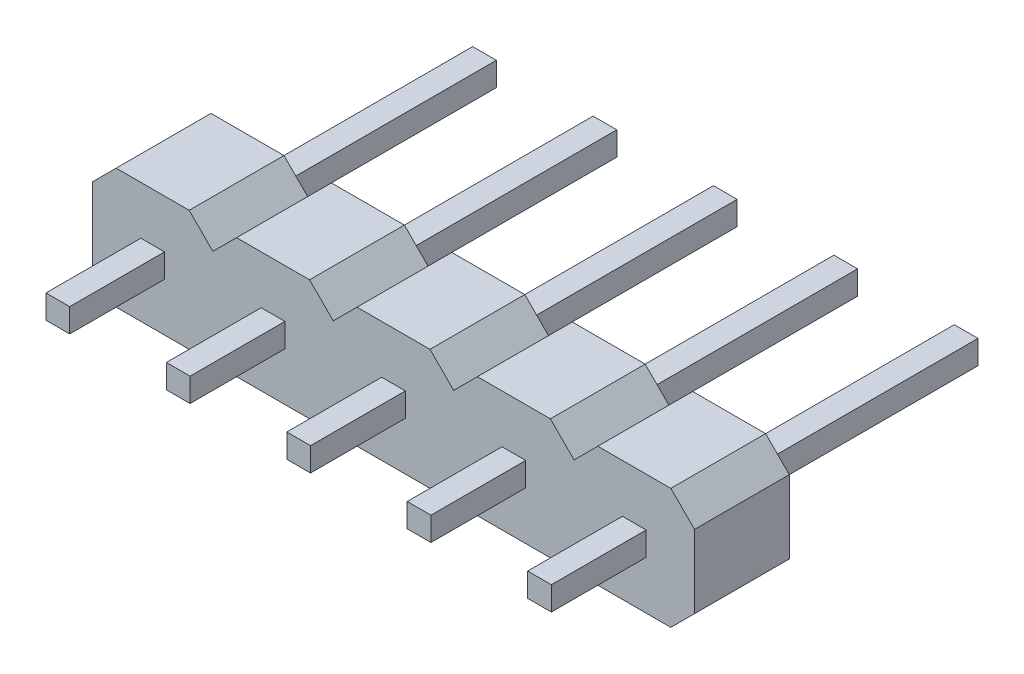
from build123d import *

# Parameters (mm, degrees)
HEADER_BLOCKS_DEPTH = 2
PINS_DEPTH          = 2
PINS_DEPTH_BACK     = 7
SKETCH2_W           = 0.5
SKETCH2_H           = 0.5


with BuildPart() as part:
    # Sketch1 → Header blocks (new body)
    with BuildSketch(Plane.XY):
        Polygon((-8, 0.5), (-8.5, 0), (-10.04, 0), (-10.54, 0.5), (-11.04, 0), (-12.58, 0), (-13.08, 0.5), (-13.58, 0), (-15.12, 0), (-15.62, 0.5), (-16.12, 0), (-17.66, 0), (-18.16, 0.5), (-18.66, 0), (-20.2, 0), (-20.7, 0.5), (-20.7, 2.04), (-20.2, 2.54), (-18.66, 2.54), (-18.16, 2.04), (-17.66, 2.54), (-16.12, 2.54), (-15.62, 2.04), (-15.12, 2.54), (-13.58, 2.54), (-13.08, 2.04), (-12.58, 2.54), (-11.04, 2.54), (-10.54, 2.04), (-10.04, 2.54), (-8.5, 2.54), (-8, 2.04), align=None)
    extrude(amount=HEADER_BLOCKS_DEPTH)

    # Sketch2 → Pins (add, two sides: drawn at the far end of the back side and taken through both)
    with BuildSketch(Plane.XY.offset(2).offset(-PINS_DEPTH_BACK)):
        with Locations((-9.27, 1.27)):
            Rectangle(SKETCH2_W, SKETCH2_H)
        with Locations((-11.81, 1.27)):
            Rectangle(SKETCH2_W, SKETCH2_H)
        with Locations((-14.35, 1.27)):
            Rectangle(SKETCH2_W, SKETCH2_H)
        with Locations((-16.89, 1.27)):
            Rectangle(SKETCH2_W, SKETCH2_H)
        with Locations((-19.43, 1.27)):
            Rectangle(SKETCH2_W, SKETCH2_H)
    extrude(amount=PINS_DEPTH + PINS_DEPTH_BACK)


solid = part.part
